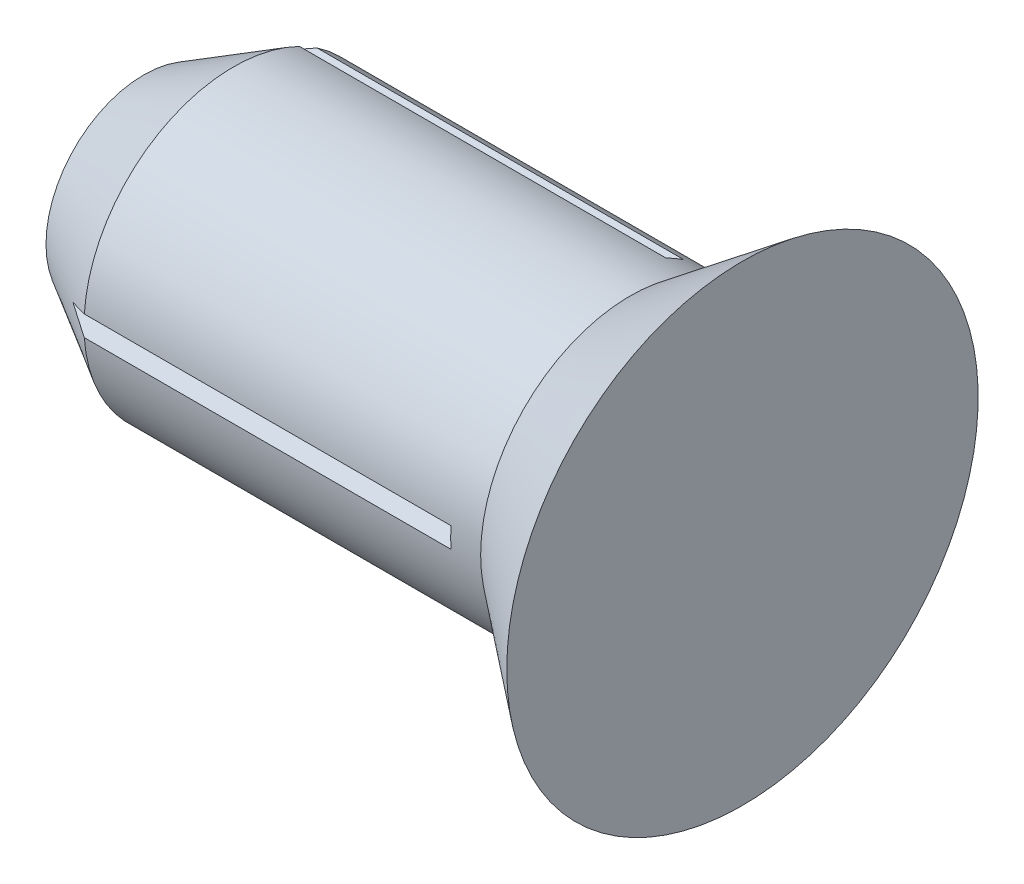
from build123d import *

# Parameters (mm, degrees)
CUT_EXTRUDE1_DEPTH = 30.506454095
CIRPATTERN1_COUNT  = 3


with BuildPart() as part:
    # Sketch1 → Base-Revolve (revolve)
    with BuildSketch(Plane.XY, mode=Mode.PRIVATE) as base_revolve_sk:
        Polygon((-32.506454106, 0), (-32.506454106, 6.535898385), (-26.506454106, 10), (0, 10), (7.493545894, 15.75), (7.493545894, 0), align=None)
    revolve(base_revolve_sk.sketch.rotate(Axis((-40, 0, 0), (1, 0, 0)), 90), axis=Axis((-40, 0, 0), (1, 0, 0)))

    # Sketch2 → Cut-Extrude1 (cut)
    with BuildSketch(Plane.ZY.offset(32.506454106)):
        Polygon((9, 0), (10, 0.700207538), (10, -0.700207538), align=None)
    cut_extrude1 = extrude(amount=-CUT_EXTRUDE1_DEPTH, mode=Mode.SUBTRACT)

    # CirPattern1: Cut-Extrude1 ×3 about axis
    cirpattern1_axis = Axis((0, 0, 0), (1, 0, 0))
    for i in range(1, CIRPATTERN1_COUNT):
        add(cut_extrude1.rotate(cirpattern1_axis, i * 360 / CIRPATTERN1_COUNT), mode=Mode.SUBTRACT)


solid = part.part
